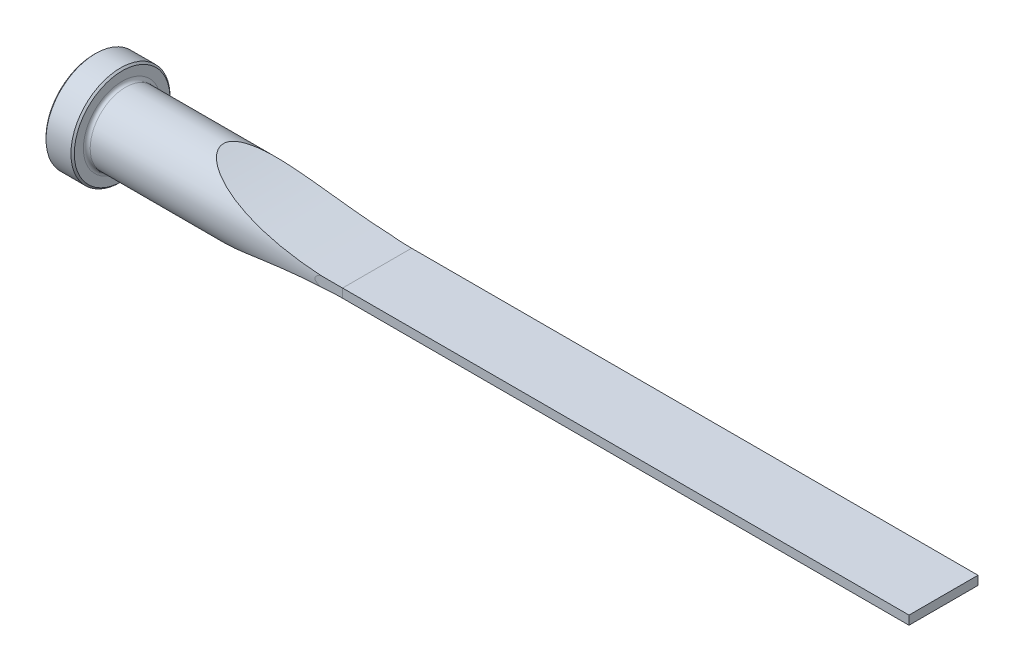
from build123d import *

# Parameters (mm, degrees)
CUT_EXTRUDE1_DEPTH = 192.147130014
CUT_EXTRUDE2_DEPTH = 192.147130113
FILLET1_R          = 0.762
CHAMFER1_SIZE      = 0.381


with BuildPart() as part:
    # Sketch1 → Revolve1 (revolve)
    with BuildSketch(Plane.XY, mode=Mode.PRIVATE) as revolve1_sk:
        Polygon((0, 0), (0, 11.1125), (6.35, 11.1125), (6.35, 7.9375), (190.5, 7.9375), (190.5, 0), align=None)
    revolve(revolve1_sk.sketch.rotate(Axis((0, 0, 0), (1, 0, 0)), 90), axis=Axis((0, 0, 0), (1, 0, 0)))

    # Sketch2 → Cut-Extrude1 (cut, symmetric)
    with BuildSketch(Plane.XY):
        with BuildLine():
            Line((190.5, 7.9375), (190.5, 0.9906))
            Line((190.5, 0.9906), (63.5, 0.9906))
            ThreePointArc((63.5, 0.9906), (45.927586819, 2.744628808), (29.048593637, 7.9375))
            Line((29.048593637, 7.9375), (190.5, 7.9375))
        make_face()
    cut_extrude1 = extrude(amount=CUT_EXTRUDE1_DEPTH, both=True, mode=Mode.SUBTRACT)

    # Mirror1: Cut-Extrude1 across plane
    add(cut_extrude1.mirror(Plane.ZX), mode=Mode.SUBTRACT)

    # Sketch3 → Cut-Extrude2 (cut, symmetric)
    with BuildSketch(Plane(origin=(0, 0, 0), x_dir=(1, 0, 0), z_dir=(0, 1, 0))):
        with BuildLine():
            Line((190.5, 7.9375), (190.5, 7.7343))
            Line((190.5, 7.7343), (63.5, 7.7343))
            ThreePointArc((63.5, 7.7343), (60.49463147, 7.785114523), (57.492698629, 7.9375))
            Line((57.492698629, 7.9375), (190.5, 7.9375))
        make_face()
    cut_extrude2 = extrude(amount=CUT_EXTRUDE2_DEPTH, both=True, mode=Mode.SUBTRACT)

    # Mirror2: Cut-Extrude2 across plane
    add(cut_extrude2.mirror(Plane.XY), mode=Mode.SUBTRACT)

    # Fillet1
    fillet1_edges = [part.edges().sort_by_distance(p)[0] for p in [
        (6.35, 0, -7.9375),
    ]]
    fillet(fillet1_edges, radius=FILLET1_R)

    # Chamfer1
    chamfer1_edges = [part.edges().sort_by_distance(p)[0] for p in [
        (6.35, 0, -11.1125),
        (0, 0, -11.1125),
    ]]
    chamfer(chamfer1_edges, length=CHAMFER1_SIZE)


solid = part.part
